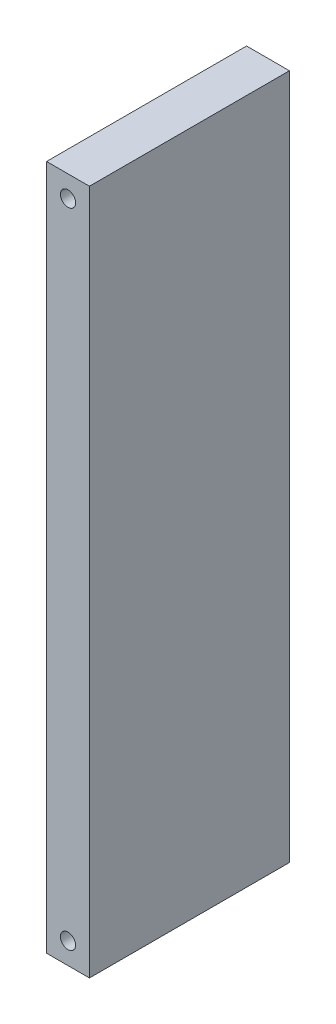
ISO-10303-21;
HEADER;
FILE_DESCRIPTION(('STEP AP214'),'2;1');
FILE_NAME('part.step','',(''),(''),'','','');
FILE_SCHEMA(('AUTOMOTIVE_DESIGN { 1 0 10303 214 1 1 1 1 }'));
ENDSEC;
DATA;
#1=APPLICATION_CONTEXT('core data for automotive mechanical design processes');
#2=APPLICATION_PROTOCOL_DEFINITION('international standard','automotive_design',2000,#1);
#3=PRODUCT_CONTEXT('',#1,'mechanical');
#4=PRODUCT('Part','Part','',(#3));
#5=PRODUCT_RELATED_PRODUCT_CATEGORY('part','',(#4));
#6=PRODUCT_DEFINITION_FORMATION('','',#4);
#7=PRODUCT_DEFINITION_CONTEXT('part definition',#1,'design');
#8=PRODUCT_DEFINITION('design','',#6,#7);
#9=PRODUCT_DEFINITION_SHAPE('','',#8);
#10=(LENGTH_UNIT() NAMED_UNIT(*) SI_UNIT(.MILLI.,.METRE.));
#11=(NAMED_UNIT(*) PLANE_ANGLE_UNIT() SI_UNIT($,.RADIAN.));
#12=(NAMED_UNIT(*) SI_UNIT($,.STERADIAN.) SOLID_ANGLE_UNIT());
#13=UNCERTAINTY_MEASURE_WITH_UNIT(LENGTH_MEASURE(1.E-05),#10,'distance_accuracy_value','');
#14=(GEOMETRIC_REPRESENTATION_CONTEXT(3) GLOBAL_UNCERTAINTY_ASSIGNED_CONTEXT((#13)) GLOBAL_UNIT_ASSIGNED_CONTEXT((#10,
#11,#12)) REPRESENTATION_CONTEXT('',''));
#15=CARTESIAN_POINT('',(0.,0.,0.));
#16=DIRECTION('',(0.,0.,1.));
#17=DIRECTION('',(1.,0.,0.));
#18=AXIS2_PLACEMENT_3D('',#15,#16,#17);
#19=CARTESIAN_POINT('',(-228.6,304.8,177.8));
#20=DIRECTION('',(-1.,0.,0.));
#21=DIRECTION('',(0.,-1.,0.));
#22=AXIS2_PLACEMENT_3D('',#19,#20,#21);
#23=PLANE('',#22);
#24=DIRECTION('',(0.,1.,0.));
#25=VECTOR('',#24,1.);
#26=CARTESIAN_POINT('',(-228.6,304.8,0.));
#27=LINE('',#26,#25);
#28=CARTESIAN_POINT('',(-228.6,-304.8,0.));
#29=VERTEX_POINT('',#28);
#30=CARTESIAN_POINT('',(-228.6,304.8,0.));
#31=VERTEX_POINT('',#30);
#32=EDGE_CURVE('E136',#29,#31,#27,.T.);
#33=ORIENTED_EDGE('',*,*,#32,.T.);
#34=DIRECTION('',(0.,0.,-1.));
#35=VECTOR('',#34,1.);
#36=CARTESIAN_POINT('',(-228.6,304.8,177.8));
#37=LINE('',#36,#35);
#38=CARTESIAN_POINT('',(-228.6,304.8,177.8));
#39=VERTEX_POINT('',#38);
#40=EDGE_CURVE('E12',#39,#31,#37,.T.);
#41=ORIENTED_EDGE('',*,*,#40,.F.);
#42=DIRECTION('',(0.,1.,0.));
#43=VECTOR('',#42,1.);
#44=CARTESIAN_POINT('',(-228.6,304.8,177.8));
#45=LINE('',#44,#43);
#46=CARTESIAN_POINT('',(-228.6,-304.8,177.8));
#47=VERTEX_POINT('',#46);
#48=EDGE_CURVE('E138',#47,#39,#45,.T.);
#49=ORIENTED_EDGE('',*,*,#48,.F.);
#50=DIRECTION('',(0.,0.,-1.));
#51=VECTOR('',#50,1.);
#52=CARTESIAN_POINT('',(-228.6,-304.8,177.8));
#53=LINE('',#52,#51);
#54=EDGE_CURVE('E148',#47,#29,#53,.T.);
#55=ORIENTED_EDGE('',*,*,#54,.T.);
#56=EDGE_LOOP('',(#33,#41,#49,#55));
#57=FACE_BOUND('',#56,.T.);
#58=ADVANCED_FACE('F54',(#57),#23,.F.);
#59=CARTESIAN_POINT('',(-228.6,304.8,177.8));
#60=DIRECTION('',(0.,-1.,0.));
#61=DIRECTION('',(0.,0.,-1.));
#62=AXIS2_PLACEMENT_3D('',#59,#60,#61);
#63=PLANE('',#62);
#64=DIRECTION('',(-1.,0.,0.));
#65=VECTOR('',#64,1.);
#66=CARTESIAN_POINT('',(-228.6,304.8,0.));
#67=LINE('',#66,#65);
#68=CARTESIAN_POINT('',(-266.7,304.8,0.));
#69=VERTEX_POINT('',#68);
#70=EDGE_CURVE('E152',#31,#69,#67,.T.);
#71=ORIENTED_EDGE('',*,*,#70,.T.);
#72=DIRECTION('',(0.,0.,-1.));
#73=VECTOR('',#72,1.);
#74=CARTESIAN_POINT('',(-266.7,304.8,177.8));
#75=LINE('',#74,#73);
#76=CARTESIAN_POINT('',(-266.7,304.8,177.8));
#77=VERTEX_POINT('',#76);
#78=EDGE_CURVE('E63',#77,#69,#75,.T.);
#79=ORIENTED_EDGE('',*,*,#78,.F.);
#80=DIRECTION('',(-1.,0.,0.));
#81=VECTOR('',#80,1.);
#82=CARTESIAN_POINT('',(-228.6,304.8,177.8));
#83=LINE('',#82,#81);
#84=EDGE_CURVE('E102',#39,#77,#83,.T.);
#85=ORIENTED_EDGE('',*,*,#84,.F.);
#86=ORIENTED_EDGE('',*,*,#40,.T.);
#87=EDGE_LOOP('',(#71,#79,#85,#86));
#88=FACE_BOUND('',#87,.T.);
#89=ADVANCED_FACE('F183',(#88),#63,.F.);
#90=CARTESIAN_POINT('',(-266.7,304.8,177.8));
#91=DIRECTION('',(1.,0.,0.));
#92=DIRECTION('',(0.,1.,0.));
#93=AXIS2_PLACEMENT_3D('',#90,#91,#92);
#94=PLANE('',#93);
#95=DIRECTION('',(0.,-1.,0.));
#96=VECTOR('',#95,1.);
#97=CARTESIAN_POINT('',(-266.7,304.8,0.));
#98=LINE('',#97,#96);
#99=CARTESIAN_POINT('',(-266.7,-304.8,0.));
#100=VERTEX_POINT('',#99);
#101=EDGE_CURVE('E89',#69,#100,#98,.T.);
#102=ORIENTED_EDGE('',*,*,#101,.T.);
#103=DIRECTION('',(0.,0.,-1.));
#104=VECTOR('',#103,1.);
#105=CARTESIAN_POINT('',(-266.7,-304.8,177.8));
#106=LINE('',#105,#104);
#107=CARTESIAN_POINT('',(-266.7,-304.8,177.8));
#108=VERTEX_POINT('',#107);
#109=EDGE_CURVE('E161',#108,#100,#106,.T.);
#110=ORIENTED_EDGE('',*,*,#109,.F.);
#111=DIRECTION('',(0.,-1.,0.));
#112=VECTOR('',#111,1.);
#113=CARTESIAN_POINT('',(-266.7,304.8,177.8));
#114=LINE('',#113,#112);
#115=EDGE_CURVE('E143',#77,#108,#114,.T.);
#116=ORIENTED_EDGE('',*,*,#115,.F.);
#117=ORIENTED_EDGE('',*,*,#78,.T.);
#118=EDGE_LOOP('',(#102,#110,#116,#117));
#119=FACE_BOUND('',#118,.T.);
#120=ADVANCED_FACE('F166',(#119),#94,.F.);
#121=CARTESIAN_POINT('',(-228.6,-304.8,177.8));
#122=DIRECTION('',(0.,1.,0.));
#123=DIRECTION('',(-1.,0.,0.));
#124=AXIS2_PLACEMENT_3D('',#121,#122,#123);
#125=PLANE('',#124);
#126=DIRECTION('',(1.,0.,0.));
#127=VECTOR('',#126,1.);
#128=CARTESIAN_POINT('',(-228.6,-304.8,0.));
#129=LINE('',#128,#127);
#130=EDGE_CURVE('E95',#100,#29,#129,.T.);
#131=ORIENTED_EDGE('',*,*,#130,.T.);
#132=ORIENTED_EDGE('',*,*,#54,.F.);
#133=DIRECTION('',(1.,0.,0.));
#134=VECTOR('',#133,1.);
#135=CARTESIAN_POINT('',(-228.6,-304.8,177.8));
#136=LINE('',#135,#134);
#137=EDGE_CURVE('E71',#108,#47,#136,.T.);
#138=ORIENTED_EDGE('',*,*,#137,.F.);
#139=ORIENTED_EDGE('',*,*,#109,.T.);
#140=EDGE_LOOP('',(#131,#132,#138,#139));
#141=FACE_BOUND('',#140,.T.);
#142=ADVANCED_FACE('F173',(#141),#125,.F.);
#143=CARTESIAN_POINT('',(0.,0.,177.8));
#144=DIRECTION('',(0.,0.,-1.));
#145=DIRECTION('',(-1.,0.,0.));
#146=AXIS2_PLACEMENT_3D('',#143,#144,#145);
#147=PLANE('',#146);
#148=CARTESIAN_POINT('',(-247.65,-285.75,177.8));
#149=DIRECTION('',(0.,0.,1.));
#150=DIRECTION('',(1.,0.,0.));
#151=AXIS2_PLACEMENT_3D('',#148,#149,#150);
#152=CIRCLE('',#151,6.74751000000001);
#153=CARTESIAN_POINT('',(-240.90249,-285.75,177.8));
#154=VERTEX_POINT('',#153);
#155=EDGE_CURVE('E119',#154,#154,#152,.T.);
#156=ORIENTED_EDGE('',*,*,#155,.F.);
#157=EDGE_LOOP('',(#156));
#158=FACE_BOUND('',#157,.T.);
#159=CARTESIAN_POINT('',(-247.65,285.75,177.8));
#160=DIRECTION('',(0.,0.,1.));
#161=DIRECTION('',(1.,0.,0.));
#162=AXIS2_PLACEMENT_3D('',#159,#160,#161);
#163=CIRCLE('',#162,6.74751000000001);
#164=CARTESIAN_POINT('',(-240.90249,285.75,177.8));
#165=VERTEX_POINT('',#164);
#166=EDGE_CURVE('E131',#165,#165,#163,.T.);
#167=ORIENTED_EDGE('',*,*,#166,.F.);
#168=EDGE_LOOP('',(#167));
#169=FACE_BOUND('',#168,.T.);
#170=ORIENTED_EDGE('',*,*,#48,.T.);
#171=ORIENTED_EDGE('',*,*,#84,.T.);
#172=ORIENTED_EDGE('',*,*,#115,.T.);
#173=ORIENTED_EDGE('',*,*,#137,.T.);
#174=EDGE_LOOP('',(#170,#171,#172,#173));
#175=FACE_BOUND('',#174,.T.);
#176=ADVANCED_FACE('F175',(#158,#169,#175),#147,.F.);
#177=CARTESIAN_POINT('',(0.,0.,0.));
#178=DIRECTION('',(0.,0.,-1.));
#179=DIRECTION('',(-1.,0.,0.));
#180=AXIS2_PLACEMENT_3D('',#177,#178,#179);
#181=PLANE('',#180);
#182=ORIENTED_EDGE('',*,*,#32,.F.);
#183=ORIENTED_EDGE('',*,*,#130,.F.);
#184=ORIENTED_EDGE('',*,*,#101,.F.);
#185=ORIENTED_EDGE('',*,*,#70,.F.);
#186=EDGE_LOOP('',(#182,#183,#184,#185));
#187=FACE_BOUND('',#186,.T.);
#188=ADVANCED_FACE('F169',(#187),#181,.T.);
#189=CARTESIAN_POINT('',(-247.65,285.75,177.8));
#190=DIRECTION('',(0.,0.,1.));
#191=DIRECTION('',(1.,0.,0.));
#192=AXIS2_PLACEMENT_3D('',#189,#190,#191);
#193=CYLINDRICAL_SURFACE('',#192,6.74751);
#194=CARTESIAN_POINT('',(-247.65,285.75,122.174));
#195=DIRECTION('',(0.,0.,1.));
#196=DIRECTION('',(1.,0.,0.));
#197=AXIS2_PLACEMENT_3D('',#194,#195,#196);
#198=CIRCLE('',#197,6.74750999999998);
#199=CARTESIAN_POINT('',(-240.90249,285.75,122.174));
#200=VERTEX_POINT('',#199);
#201=EDGE_CURVE('E124',#200,#200,#198,.T.);
#202=ORIENTED_EDGE('',*,*,#201,.F.);
#203=EDGE_LOOP('',(#202));
#204=FACE_BOUND('',#203,.T.);
#205=ORIENTED_EDGE('',*,*,#166,.T.);
#206=EDGE_LOOP('',(#205));
#207=FACE_BOUND('',#206,.T.);
#208=ADVANCED_FACE('F217',(#204,#207),#193,.F.);
#209=CARTESIAN_POINT('',(-247.65,285.75,122.174));
#210=DIRECTION('',(0.,0.,1.));
#211=DIRECTION('',(1.,0.,0.));
#212=AXIS2_PLACEMENT_3D('',#209,#210,#211);
#213=CONICAL_SURFACE('',#212,6.74750999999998,1.02974425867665);
#214=CARTESIAN_POINT('',(-247.65,285.75,118.119686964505));
#215=VERTEX_POINT('',#214);
#216=VERTEX_LOOP('',#215);
#217=FACE_BOUND('',#216,.T.);
#218=ORIENTED_EDGE('',*,*,#201,.T.);
#219=EDGE_LOOP('',(#218));
#220=FACE_BOUND('',#219,.T.);
#221=ADVANCED_FACE('F227',(#217,#220),#213,.F.);
#222=CARTESIAN_POINT('',(-247.65,-285.75,177.8));
#223=DIRECTION('',(0.,0.,1.));
#224=DIRECTION('',(1.,0.,0.));
#225=AXIS2_PLACEMENT_3D('',#222,#223,#224);
#226=CYLINDRICAL_SURFACE('',#225,6.74751);
#227=CARTESIAN_POINT('',(-247.65,-285.75,122.174));
#228=DIRECTION('',(0.,0.,1.));
#229=DIRECTION('',(1.,0.,0.));
#230=AXIS2_PLACEMENT_3D('',#227,#228,#229);
#231=CIRCLE('',#230,6.74750999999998);
#232=CARTESIAN_POINT('',(-240.90249,-285.75,122.174));
#233=VERTEX_POINT('',#232);
#234=EDGE_CURVE('E116',#233,#233,#231,.T.);
#235=ORIENTED_EDGE('',*,*,#234,.F.);
#236=EDGE_LOOP('',(#235));
#237=FACE_BOUND('',#236,.T.);
#238=ORIENTED_EDGE('',*,*,#155,.T.);
#239=EDGE_LOOP('',(#238));
#240=FACE_BOUND('',#239,.T.);
#241=ADVANCED_FACE('F112',(#237,#240),#226,.F.);
#242=CARTESIAN_POINT('',(-247.65,-285.75,122.174));
#243=DIRECTION('',(0.,0.,1.));
#244=DIRECTION('',(1.,0.,0.));
#245=AXIS2_PLACEMENT_3D('',#242,#243,#244);
#246=CONICAL_SURFACE('',#245,6.74750999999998,1.02974425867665);
#247=CARTESIAN_POINT('',(-247.65,-285.75,118.119686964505));
#248=VERTEX_POINT('',#247);
#249=VERTEX_LOOP('',#248);
#250=FACE_BOUND('',#249,.T.);
#251=ORIENTED_EDGE('',*,*,#234,.T.);
#252=EDGE_LOOP('',(#251));
#253=FACE_BOUND('',#252,.T.);
#254=ADVANCED_FACE('F109',(#250,#253),#246,.F.);
#255=CLOSED_SHELL('',(#58,#89,#120,#142,#176,#188,#208,#221,#241,#254));
#256=MANIFOLD_SOLID_BREP('B2',#255);
#257=ADVANCED_BREP_SHAPE_REPRESENTATION('',(#18,#256),#14);
#258=SHAPE_DEFINITION_REPRESENTATION(#9,#257);
ENDSEC;
END-ISO-10303-21;
